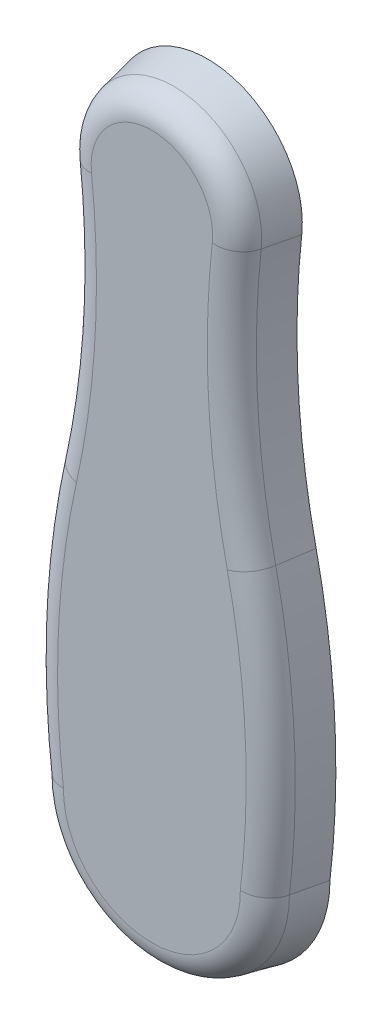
ISO-10303-21;
HEADER;
FILE_DESCRIPTION(('STEP AP214'),'2;1');
FILE_NAME('part.step','',(''),(''),'','','');
FILE_SCHEMA(('AUTOMOTIVE_DESIGN { 1 0 10303 214 1 1 1 1 }'));
ENDSEC;
DATA;
#1=APPLICATION_CONTEXT('core data for automotive mechanical design processes');
#2=APPLICATION_PROTOCOL_DEFINITION('international standard','automotive_design',2000,#1);
#3=PRODUCT_CONTEXT('',#1,'mechanical');
#4=PRODUCT('Part','Part','',(#3));
#5=PRODUCT_RELATED_PRODUCT_CATEGORY('part','',(#4));
#6=PRODUCT_DEFINITION_FORMATION('','',#4);
#7=PRODUCT_DEFINITION_CONTEXT('part definition',#1,'design');
#8=PRODUCT_DEFINITION('design','',#6,#7);
#9=PRODUCT_DEFINITION_SHAPE('','',#8);
#10=(LENGTH_UNIT() NAMED_UNIT(*) SI_UNIT(.MILLI.,.METRE.));
#11=(NAMED_UNIT(*) PLANE_ANGLE_UNIT() SI_UNIT($,.RADIAN.));
#12=(NAMED_UNIT(*) SI_UNIT($,.STERADIAN.) SOLID_ANGLE_UNIT());
#13=UNCERTAINTY_MEASURE_WITH_UNIT(LENGTH_MEASURE(1.E-05),#10,'distance_accuracy_value','');
#14=(GEOMETRIC_REPRESENTATION_CONTEXT(3) GLOBAL_UNCERTAINTY_ASSIGNED_CONTEXT((#13)) GLOBAL_UNIT_ASSIGNED_CONTEXT((#10,
#11,#12)) REPRESENTATION_CONTEXT('',''));
#15=CARTESIAN_POINT('',(0.,0.,0.));
#16=DIRECTION('',(0.,0.,1.));
#17=DIRECTION('',(1.,0.,0.));
#18=AXIS2_PLACEMENT_3D('',#15,#16,#17);
#19=CARTESIAN_POINT('',(-328.083559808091,164.486935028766,20.));
#20=DIRECTION('',(0.,0.,1.));
#21=DIRECTION('',(-1.,0.,0.));
#22=AXIS2_PLACEMENT_3D('',#19,#20,#21);
#23=CONICAL_SURFACE('',#22,300.,0.20943951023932);
#24=DIRECTION('',(-0.203051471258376,0.0446919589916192,-0.978147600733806));
#25=VECTOR('',#24,1.);
#26=CARTESIAN_POINT('',(-35.0964692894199,100.,20.));
#27=LINE('',#26,#25);
#28=CARTESIAN_POINT('',(-36.7407476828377,100.361908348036,12.0791169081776));
#29=VERTEX_POINT('',#28);
#30=CARTESIAN_POINT('',(-39.24822452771,100.913808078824,0.));
#31=VERTEX_POINT('',#30);
#32=EDGE_CURVE('E114',#29,#31,#27,.T.);
#33=ORIENTED_EDGE('',*,*,#32,.F.);
#34=CARTESIAN_POINT('',(-328.083559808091,164.486935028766,12.0791169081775));
#35=DIRECTION('',(0.,0.,-1.));
#36=DIRECTION('',(-1.,0.,0.));
#37=AXIS2_PLACEMENT_3D('',#34,#35,#36);
#38=CIRCLE('',#37,298.316364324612);
#39=CARTESIAN_POINT('',(-31.4996363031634,196.590354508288,12.0791169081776));
#40=VERTEX_POINT('',#39);
#41=EDGE_CURVE('E51',#29,#40,#38,.F.);
#42=ORIENTED_EDGE('',*,*,#41,.T.);
#43=DIRECTION('',(-0.206704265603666,-0.0223744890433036,-0.978147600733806));
#44=VECTOR('',#43,1.);
#45=CARTESIAN_POINT('',(-29.8257781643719,196.77153954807,20.));
#46=LINE('',#45,#44);
#47=CARTESIAN_POINT('',(-34.0522214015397,196.314052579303,0.));
#48=VERTEX_POINT('',#47);
#49=EDGE_CURVE('E140',#40,#48,#46,.T.);
#50=ORIENTED_EDGE('',*,*,#49,.T.);
#51=CARTESIAN_POINT('',(-328.083559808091,164.486935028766,0.));
#52=DIRECTION('',(0.,0.,-1.));
#53=DIRECTION('',(-1.,0.,0.));
#54=AXIS2_PLACEMENT_3D('',#51,#52,#53);
#55=CIRCLE('',#54,295.7488687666);
#56=EDGE_CURVE('E123',#48,#31,#55,.T.);
#57=ORIENTED_EDGE('',*,*,#56,.T.);
#58=EDGE_LOOP('',(#33,#42,#50,#57));
#59=FACE_BOUND('',#58,.T.);
#60=ADVANCED_FACE('F34',(#59),#23,.F.);
#61=CARTESIAN_POINT('',(257.890621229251,35.5130649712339,20.));
#62=DIRECTION('',(0.,0.,-1.));
#63=DIRECTION('',(1.,0.,0.));
#64=AXIS2_PLACEMENT_3D('',#61,#62,#63);
#65=CONICAL_SURFACE('',#64,300.,0.20943951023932);
#66=CARTESIAN_POINT('',(-40.,0.,20.));
#67=CARTESIAN_POINT('',(-40.708515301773,-0.0421104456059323,16.6666804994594));
#68=CARTESIAN_POINT('',(-41.4169712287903,-0.0846628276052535,13.3333540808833));
#69=CARTESIAN_POINT('',(-42.83376433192,-0.170651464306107,6.6666874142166));
#70=CARTESIAN_POINT('',(-43.5421015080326,-0.2140877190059,3.33334716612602));
#71=CARTESIAN_POINT('',(-44.2503793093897,-0.257965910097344,0.));
#72=B_SPLINE_CURVE_WITH_KNOTS('',3,(#66,#67,#68,#69,#70,#71),.UNSPECIFIED.,.F.,.F.,(4,2,4),(0.,
10.2241415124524,20.4482830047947),.UNSPECIFIED.);
#73=CARTESIAN_POINT('',(-41.6835135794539,-0.100889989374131,12.0791169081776));
#74=VERTEX_POINT('',#73);
#75=CARTESIAN_POINT('',(-44.2503793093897,-0.257965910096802,0.));
#76=VERTEX_POINT('',#75);
#77=EDGE_CURVE('E106',#74,#76,#72,.T.);
#78=ORIENTED_EDGE('',*,*,#77,.F.);
#79=CARTESIAN_POINT('',(257.890621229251,35.5130649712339,12.0791169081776));
#80=DIRECTION('',(0.,0.,1.));
#81=DIRECTION('',(1.,0.,0.));
#82=AXIS2_PLACEMENT_3D('',#79,#80,#81);
#83=CIRCLE('',#82,301.683635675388);
#84=EDGE_CURVE('E59',#74,#29,#83,.F.);
#85=ORIENTED_EDGE('',*,*,#84,.T.);
#86=ORIENTED_EDGE('',*,*,#32,.T.);
#87=CARTESIAN_POINT('',(257.890621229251,35.5130649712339,0.));
#88=DIRECTION('',(0.,0.,-1.));
#89=DIRECTION('',(-1.,0.,0.));
#90=AXIS2_PLACEMENT_3D('',#87,#88,#89);
#91=CIRCLE('',#90,304.251131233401);
#92=EDGE_CURVE('E118',#31,#76,#91,.F.);
#93=ORIENTED_EDGE('',*,*,#92,.T.);
#94=EDGE_LOOP('',(#78,#85,#86,#93));
#95=FACE_BOUND('',#94,.T.);
#96=ADVANCED_FACE('F119',(#95),#65,.T.);
#97=CARTESIAN_POINT('',(0.,0.,20.));
#98=DIRECTION('',(0.,0.,-1.));
#99=DIRECTION('',(1.,0.,0.));
#100=AXIS2_PLACEMENT_3D('',#97,#98,#99);
#101=CONICAL_SURFACE('',#100,40.,0.20943951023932);
#102=CARTESIAN_POINT('',(40.,0.,20.));
#103=CARTESIAN_POINT('',(40.7085153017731,-0.0421104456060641,16.6666804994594));
#104=CARTESIAN_POINT('',(41.4169712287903,-0.0846628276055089,13.3333540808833));
#105=CARTESIAN_POINT('',(42.83376433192,-0.17065146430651,6.66668741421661));
#106=CARTESIAN_POINT('',(43.5421015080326,-0.214087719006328,3.33334716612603));
#107=CARTESIAN_POINT('',(44.2503793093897,-0.257965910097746,0.));
#108=B_SPLINE_CURVE_WITH_KNOTS('',3,(#102,#103,#104,#105,#106,#107),.UNSPECIFIED.,.F.,.F.,(4,2,
4),(0.,10.2241415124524,20.4482830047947),.UNSPECIFIED.);
#109=CARTESIAN_POINT('',(41.683513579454,-0.100889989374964,12.0791169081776));
#110=VERTEX_POINT('',#109);
#111=CARTESIAN_POINT('',(44.2503793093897,-0.257965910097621,0.));
#112=VERTEX_POINT('',#111);
#113=EDGE_CURVE('E115',#110,#112,#108,.T.);
#114=ORIENTED_EDGE('',*,*,#113,.F.);
#115=CARTESIAN_POINT('',(0.,0.,12.0791169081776));
#116=DIRECTION('',(0.,0.,1.));
#117=DIRECTION('',(1.,0.,0.));
#118=AXIS2_PLACEMENT_3D('',#115,#116,#117);
#119=CIRCLE('',#118,41.683635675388);
#120=EDGE_CURVE('E43',#110,#74,#119,.F.);
#121=ORIENTED_EDGE('',*,*,#120,.T.);
#122=ORIENTED_EDGE('',*,*,#77,.T.);
#123=CARTESIAN_POINT('',(0.,0.,0.));
#124=DIRECTION('',(0.,0.,-1.));
#125=DIRECTION('',(-1.,0.,0.));
#126=AXIS2_PLACEMENT_3D('',#123,#124,#125);
#127=CIRCLE('',#126,44.2511312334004);
#128=EDGE_CURVE('E111',#76,#112,#127,.F.);
#129=ORIENTED_EDGE('',*,*,#128,.T.);
#130=EDGE_LOOP('',(#114,#121,#122,#129));
#131=FACE_BOUND('',#130,.T.);
#132=ADVANCED_FACE('F109',(#131),#101,.T.);
#133=CARTESIAN_POINT('',(-257.890621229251,35.513064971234,20.));
#134=DIRECTION('',(0.,0.,-1.));
#135=DIRECTION('',(-1.,0.,0.));
#136=AXIS2_PLACEMENT_3D('',#133,#134,#135);
#137=CONICAL_SURFACE('',#136,300.,0.20943951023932);
#138=DIRECTION('',(0.203051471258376,0.0446919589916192,-0.978147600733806));
#139=VECTOR('',#138,1.);
#140=CARTESIAN_POINT('',(35.0964692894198,100.,20.));
#141=LINE('',#140,#139);
#142=CARTESIAN_POINT('',(36.7407476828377,100.361908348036,12.0791169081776));
#143=VERTEX_POINT('',#142);
#144=CARTESIAN_POINT('',(39.24822452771,100.913808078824,0.));
#145=VERTEX_POINT('',#144);
#146=EDGE_CURVE('E133',#143,#145,#141,.T.);
#147=ORIENTED_EDGE('',*,*,#146,.F.);
#148=CARTESIAN_POINT('',(-257.890621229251,35.513064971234,12.0791169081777));
#149=DIRECTION('',(0.,0.,1.));
#150=DIRECTION('',(1.,0.,0.));
#151=AXIS2_PLACEMENT_3D('',#148,#149,#150);
#152=CIRCLE('',#151,301.683635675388);
#153=EDGE_CURVE('E156',#143,#110,#152,.F.);
#154=ORIENTED_EDGE('',*,*,#153,.T.);
#155=ORIENTED_EDGE('',*,*,#113,.T.);
#156=CARTESIAN_POINT('',(-257.890621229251,35.513064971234,0.));
#157=DIRECTION('',(0.,0.,-1.));
#158=DIRECTION('',(-1.,0.,0.));
#159=AXIS2_PLACEMENT_3D('',#156,#157,#158);
#160=CIRCLE('',#159,304.2511312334);
#161=EDGE_CURVE('E128',#112,#145,#160,.F.);
#162=ORIENTED_EDGE('',*,*,#161,.T.);
#163=EDGE_LOOP('',(#147,#154,#155,#162));
#164=FACE_BOUND('',#163,.T.);
#165=ADVANCED_FACE('F217',(#164),#137,.T.);
#166=CARTESIAN_POINT('',(328.08355980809,164.486935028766,20.));
#167=DIRECTION('',(0.,0.,1.));
#168=DIRECTION('',(1.,0.,0.));
#169=AXIS2_PLACEMENT_3D('',#166,#167,#168);
#170=CONICAL_SURFACE('',#169,300.,0.20943951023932);
#171=DIRECTION('',(0.206704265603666,-0.0223744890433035,-0.978147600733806));
#172=VECTOR('',#171,1.);
#173=CARTESIAN_POINT('',(29.8257781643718,196.77153954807,20.));
#174=LINE('',#173,#172);
#175=CARTESIAN_POINT('',(31.4996363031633,196.590354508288,12.0791169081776));
#176=VERTEX_POINT('',#175);
#177=CARTESIAN_POINT('',(34.0522214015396,196.314052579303,0.));
#178=VERTEX_POINT('',#177);
#179=EDGE_CURVE('E224',#176,#178,#174,.T.);
#180=ORIENTED_EDGE('',*,*,#179,.F.);
#181=CARTESIAN_POINT('',(328.08355980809,164.486935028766,12.0791169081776));
#182=DIRECTION('',(0.,0.,-1.));
#183=DIRECTION('',(-1.,0.,0.));
#184=AXIS2_PLACEMENT_3D('',#181,#182,#183);
#185=CIRCLE('',#184,298.316364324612);
#186=EDGE_CURVE('E159',#176,#143,#185,.F.);
#187=ORIENTED_EDGE('',*,*,#186,.T.);
#188=ORIENTED_EDGE('',*,*,#146,.T.);
#189=CARTESIAN_POINT('',(328.08355980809,164.486935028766,0.));
#190=DIRECTION('',(0.,0.,-1.));
#191=DIRECTION('',(-1.,0.,0.));
#192=AXIS2_PLACEMENT_3D('',#189,#190,#191);
#193=CIRCLE('',#192,295.748868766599);
#194=EDGE_CURVE('E130',#145,#178,#193,.T.);
#195=ORIENTED_EDGE('',*,*,#194,.T.);
#196=EDGE_LOOP('',(#180,#187,#188,#195));
#197=FACE_BOUND('',#196,.T.);
#198=ADVANCED_FACE('F214',(#197),#170,.F.);
#199=CARTESIAN_POINT('',(0.,200.,20.));
#200=DIRECTION('',(0.,0.,-1.));
#201=DIRECTION('',(1.,0.,0.));
#202=AXIS2_PLACEMENT_3D('',#199,#200,#201);
#203=CONICAL_SURFACE('',#202,29.9999999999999,0.20943951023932);
#204=ORIENTED_EDGE('',*,*,#49,.F.);
#205=CARTESIAN_POINT('',(0.,200.,12.0791169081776));
#206=DIRECTION('',(0.,0.,1.));
#207=DIRECTION('',(1.,0.,0.));
#208=AXIS2_PLACEMENT_3D('',#205,#206,#207);
#209=CIRCLE('',#208,31.6836356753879);
#210=EDGE_CURVE('E11',#40,#176,#209,.F.);
#211=ORIENTED_EDGE('',*,*,#210,.T.);
#212=ORIENTED_EDGE('',*,*,#179,.T.);
#213=CARTESIAN_POINT('',(0.,200.,0.));
#214=DIRECTION('',(0.,0.,-1.));
#215=DIRECTION('',(-1.,0.,0.));
#216=AXIS2_PLACEMENT_3D('',#213,#214,#215);
#217=CIRCLE('',#216,34.2511312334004);
#218=EDGE_CURVE('E137',#178,#48,#217,.F.);
#219=ORIENTED_EDGE('',*,*,#218,.T.);
#220=EDGE_LOOP('',(#204,#211,#212,#219));
#221=FACE_BOUND('',#220,.T.);
#222=ADVANCED_FACE('F211',(#221),#203,.T.);
#223=CARTESIAN_POINT('',(-35.0964692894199,100.,20.));
#224=DIRECTION('',(0.,0.,-1.));
#225=DIRECTION('',(-1.,0.,0.));
#226=AXIS2_PLACEMENT_3D('',#223,#224,#225);
#227=PLANE('',#226);
#228=CARTESIAN_POINT('',(257.890621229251,35.5130649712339,20.));
#229=DIRECTION('',(0.,0.,-1.));
#230=DIRECTION('',(-1.,0.,0.));
#231=AXIS2_PLACEMENT_3D('',#228,#229,#230);
#232=CIRCLE('',#231,291.90215966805);
#233=CARTESIAN_POINT('',(-27.1879270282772,98.2593169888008,20.));
#234=VERTEX_POINT('',#233);
#235=CARTESIAN_POINT('',(-31.8988833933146,0.457197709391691,20.));
#236=VERTEX_POINT('',#235);
#237=EDGE_CURVE('E147',#234,#236,#232,.F.);
#238=ORIENTED_EDGE('',*,*,#237,.T.);
#239=CARTESIAN_POINT('',(0.,0.,20.));
#240=DIRECTION('',(0.,0.,-1.));
#241=DIRECTION('',(-1.,0.,0.));
#242=AXIS2_PLACEMENT_3D('',#239,#240,#241);
#243=CIRCLE('',#242,31.9021596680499);
#244=CARTESIAN_POINT('',(31.8988833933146,0.457197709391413,20.));
#245=VERTEX_POINT('',#244);
#246=EDGE_CURVE('E154',#236,#245,#243,.F.);
#247=ORIENTED_EDGE('',*,*,#246,.T.);
#248=CARTESIAN_POINT('',(-257.890621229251,35.513064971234,20.));
#249=DIRECTION('',(0.,0.,-1.));
#250=DIRECTION('',(-1.,0.,0.));
#251=AXIS2_PLACEMENT_3D('',#248,#249,#250);
#252=CIRCLE('',#251,291.90215966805);
#253=CARTESIAN_POINT('',(27.1879270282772,98.2593169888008,20.));
#254=VERTEX_POINT('',#253);
#255=EDGE_CURVE('E151',#245,#254,#252,.F.);
#256=ORIENTED_EDGE('',*,*,#255,.T.);
#257=CARTESIAN_POINT('',(328.08355980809,164.486935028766,20.));
#258=DIRECTION('',(0.,0.,-1.));
#259=DIRECTION('',(-1.,0.,0.));
#260=AXIS2_PLACEMENT_3D('',#257,#258,#259);
#261=CIRCLE('',#260,308.09784033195);
#262=CARTESIAN_POINT('',(21.7749651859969,197.642991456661,20.));
#263=VERTEX_POINT('',#262);
#264=EDGE_CURVE('E149',#254,#263,#261,.T.);
#265=ORIENTED_EDGE('',*,*,#264,.T.);
#266=CARTESIAN_POINT('',(0.,200.,20.));
#267=DIRECTION('',(0.,0.,-1.));
#268=DIRECTION('',(-1.,0.,0.));
#269=AXIS2_PLACEMENT_3D('',#266,#267,#268);
#270=CIRCLE('',#269,21.9021596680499);
#271=CARTESIAN_POINT('',(-21.7749651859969,197.642991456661,20.));
#272=VERTEX_POINT('',#271);
#273=EDGE_CURVE('E143',#263,#272,#270,.F.);
#274=ORIENTED_EDGE('',*,*,#273,.T.);
#275=CARTESIAN_POINT('',(-328.083559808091,164.486935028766,20.));
#276=DIRECTION('',(0.,0.,-1.));
#277=DIRECTION('',(-1.,0.,0.));
#278=AXIS2_PLACEMENT_3D('',#275,#276,#277);
#279=CIRCLE('',#278,308.09784033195);
#280=EDGE_CURVE('E145',#272,#234,#279,.T.);
#281=ORIENTED_EDGE('',*,*,#280,.T.);
#282=EDGE_LOOP('',(#238,#247,#256,#265,#274,#281));
#283=FACE_BOUND('',#282,.T.);
#284=ADVANCED_FACE('F213',(#283),#227,.F.);
#285=CARTESIAN_POINT('',(-35.0964692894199,100.,0.));
#286=DIRECTION('',(0.,0.,-1.));
#287=DIRECTION('',(-1.,0.,0.));
#288=AXIS2_PLACEMENT_3D('',#285,#286,#287);
#289=PLANE('',#288);
#290=ORIENTED_EDGE('',*,*,#56,.F.);
#291=ORIENTED_EDGE('',*,*,#218,.F.);
#292=ORIENTED_EDGE('',*,*,#194,.F.);
#293=ORIENTED_EDGE('',*,*,#161,.F.);
#294=ORIENTED_EDGE('',*,*,#128,.F.);
#295=ORIENTED_EDGE('',*,*,#92,.F.);
#296=EDGE_LOOP('',(#290,#291,#292,#293,#294,#295));
#297=FACE_BOUND('',#296,.T.);
#298=ADVANCED_FACE('F125',(#297),#289,.T.);
#299=CARTESIAN_POINT('',(-328.083559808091,164.486935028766,9.99999999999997));
#300=DIRECTION('',(0.,0.,-1.));
#301=DIRECTION('',(-1.,0.,0.));
#302=AXIS2_PLACEMENT_3D('',#299,#300,#301);
#303=TOROIDAL_SURFACE('',#302,308.09784033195,10.);
#304=CARTESIAN_POINT('',(-21.774965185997,197.642991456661,10.));
#305=DIRECTION('',(-0.107615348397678,0.994192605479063,0.));
#306=DIRECTION('',(-0.994192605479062,-0.107615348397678,0.));
#307=AXIS2_PLACEMENT_3D('',#304,#305,#306);
#308=CIRCLE('',#307,10.);
#309=EDGE_CURVE('E192',#40,#272,#308,.T.);
#310=ORIENTED_EDGE('',*,*,#309,.F.);
#311=ORIENTED_EDGE('',*,*,#41,.F.);
#312=CARTESIAN_POINT('',(-27.1879270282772,98.2593169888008,10.));
#313=DIRECTION('',(-0.214956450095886,-0.976623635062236,0.));
#314=DIRECTION('',(0.976623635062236,-0.214956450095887,0.));
#315=AXIS2_PLACEMENT_3D('',#312,#313,#314);
#316=CIRCLE('',#315,10.);
#317=EDGE_CURVE('E38',#234,#29,#316,.T.);
#318=ORIENTED_EDGE('',*,*,#317,.F.);
#319=ORIENTED_EDGE('',*,*,#280,.F.);
#320=EDGE_LOOP('',(#310,#311,#318,#319));
#321=FACE_BOUND('',#320,.T.);
#322=ADVANCED_FACE('F36',(#321),#303,.T.);
#323=CARTESIAN_POINT('',(257.890621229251,35.5130649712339,10.));
#324=DIRECTION('',(0.,0.,-1.));
#325=DIRECTION('',(-1.,0.,0.));
#326=AXIS2_PLACEMENT_3D('',#323,#324,#325);
#327=TOROIDAL_SURFACE('',#326,291.90215966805,10.);
#328=ORIENTED_EDGE('',*,*,#317,.T.);
#329=ORIENTED_EDGE('',*,*,#84,.F.);
#330=CARTESIAN_POINT('',(-41.683513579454,-0.100889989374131,12.0791169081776));
#331=CARTESIAN_POINT('',(-41.6251206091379,-0.097360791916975,12.3540199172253));
#332=CARTESIAN_POINT('',(-41.5550848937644,-0.0931299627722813,12.6264345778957));
#333=CARTESIAN_POINT('',(-41.3923628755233,-0.0833142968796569,13.1643726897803));
#334=CARTESIAN_POINT('',(-41.2996777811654,-0.0777295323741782,13.4298965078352));
#335=CARTESIAN_POINT('',(-41.0923535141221,-0.0652589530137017,13.95199698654));
#336=CARTESIAN_POINT('',(-40.9777287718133,-0.0583739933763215,14.208579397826));
#337=CARTESIAN_POINT('',(-40.727316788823,-0.0433647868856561,14.7111589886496));
#338=CARTESIAN_POINT('',(-40.5915297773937,-0.0352405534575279,14.9571562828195));
#339=CARTESIAN_POINT('',(-40.2996914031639,-0.0178229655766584,15.4369377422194));
#340=CARTESIAN_POINT('',(-40.1436304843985,-0.00852905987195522,15.6707160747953));
#341=CARTESIAN_POINT('',(-39.8124064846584,0.0111400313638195,16.1242835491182));
#342=CARTESIAN_POINT('',(-39.6372429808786,0.0215152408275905,16.3440723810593));
#343=CARTESIAN_POINT('',(-39.2691367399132,0.0432482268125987,16.7680201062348));
#344=CARTESIAN_POINT('',(-39.076200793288,0.0546056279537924,16.9721849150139));
#345=CARTESIAN_POINT('',(-38.6738684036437,0.0782036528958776,17.3635361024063));
#346=CARTESIAN_POINT('',(-38.4644720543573,0.090444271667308,17.5507225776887));
#347=CARTESIAN_POINT('',(-38.0305438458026,0.115708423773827,17.9069347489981));
#348=CARTESIAN_POINT('',(-37.806000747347,0.12873253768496,18.0759467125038));
#349=CARTESIAN_POINT('',(-37.3435155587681,0.155439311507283,18.3944605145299));
#350=CARTESIAN_POINT('',(-37.1055734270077,0.169121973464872,18.5439622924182));
#351=CARTESIAN_POINT('',(-36.6177515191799,0.197038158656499,18.8225367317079));
#352=CARTESIAN_POINT('',(-36.3678608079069,0.211272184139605,18.9515901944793));
#353=CARTESIAN_POINT('',(-35.8581312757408,0.2401542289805,19.1881910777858));
#354=CARTESIAN_POINT('',(-35.5982927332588,0.254802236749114,19.295739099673));
#355=CARTESIAN_POINT('',(-35.06376673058,0.284764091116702,19.491043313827));
#356=CARTESIAN_POINT('',(-34.7888695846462,0.300085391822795,19.5782249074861));
#357=CARTESIAN_POINT('',(-34.2325921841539,0.330894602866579,19.7285439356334));
#358=CARTESIAN_POINT('',(-33.9512121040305,0.346382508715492,19.7916820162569));
#359=CARTESIAN_POINT('',(-33.384800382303,0.377349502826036,19.8933289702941));
#360=CARTESIAN_POINT('',(-33.0997798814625,0.392828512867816,19.9319002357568));
#361=CARTESIAN_POINT('',(-32.527610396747,0.423679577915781,19.9843711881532));
#362=CARTESIAN_POINT('',(-32.2404631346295,0.439051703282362,19.9982890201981));
#363=CARTESIAN_POINT('',(-31.9352137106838,0.455268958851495,19.9999506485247));
#364=CARTESIAN_POINT('',(-31.9170482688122,0.456233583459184,20.0000000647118));
#365=CARTESIAN_POINT('',(-31.8988833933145,0.457197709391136,20.));
#366=B_SPLINE_CURVE_WITH_KNOTS('',3,(#330,#331,#332,#333,#334,#335,#336,#337,#338,#339,#340,
#341,#342,#343,#344,#345,#346,#347,#348,#349,#350,#351,#352,#353,#354,#355,#356,#357,#358,#359,
#360,#361,#362,#363,#364,#365),.UNSPECIFIED.,.F.,.F.,(4,2,2,2,2,2,2,2,2,2,2,2,2,2,2,2,2,4),(0.,
0.842916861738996,1.68578875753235,2.52810816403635,3.3704184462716,4.21312719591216,
5.05585460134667,5.89826133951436,6.74066328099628,7.583697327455,8.42673399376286,
9.27055754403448,10.1143574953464,10.979673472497,11.8449661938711,12.7080524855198,
13.5705032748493,13.6250762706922),.UNSPECIFIED.);
#367=EDGE_CURVE('E187',#236,#74,#366,.F.);
#368=ORIENTED_EDGE('',*,*,#367,.F.);
#369=ORIENTED_EDGE('',*,*,#237,.F.);
#370=EDGE_LOOP('',(#328,#329,#368,#369));
#371=FACE_BOUND('',#370,.T.);
#372=ADVANCED_FACE('F193',(#371),#327,.T.);
#373=CARTESIAN_POINT('',(0.,200.,10.));
#374=DIRECTION('',(0.,0.,-1.));
#375=DIRECTION('',(-1.,0.,0.));
#376=AXIS2_PLACEMENT_3D('',#373,#374,#375);
#377=TOROIDAL_SURFACE('',#376,21.9021596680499,10.);
#378=ORIENTED_EDGE('',*,*,#309,.T.);
#379=ORIENTED_EDGE('',*,*,#273,.F.);
#380=CARTESIAN_POINT('',(21.7749651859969,197.642991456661,10.));
#381=DIRECTION('',(-0.107615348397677,-0.994192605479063,0.));
#382=DIRECTION('',(0.994192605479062,-0.107615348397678,0.));
#383=AXIS2_PLACEMENT_3D('',#380,#381,#382);
#384=CIRCLE('',#383,10.);
#385=EDGE_CURVE('E173',#176,#263,#384,.T.);
#386=ORIENTED_EDGE('',*,*,#385,.F.);
#387=ORIENTED_EDGE('',*,*,#210,.F.);
#388=EDGE_LOOP('',(#378,#379,#386,#387));
#389=FACE_BOUND('',#388,.T.);
#390=ADVANCED_FACE('F183',(#389),#377,.T.);
#391=CARTESIAN_POINT('',(0.,0.,10.));
#392=DIRECTION('',(0.,0.,-1.));
#393=DIRECTION('',(-1.,0.,0.));
#394=AXIS2_PLACEMENT_3D('',#391,#392,#393);
#395=TOROIDAL_SURFACE('',#394,31.9021596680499,10.);
#396=ORIENTED_EDGE('',*,*,#367,.T.);
#397=ORIENTED_EDGE('',*,*,#120,.F.);
#398=CARTESIAN_POINT('',(41.683513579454,-0.100889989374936,12.0791169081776));
#399=CARTESIAN_POINT('',(41.6251206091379,-0.0973607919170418,12.3540199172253));
#400=CARTESIAN_POINT('',(41.5550848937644,-0.0931299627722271,12.6264345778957));
#401=CARTESIAN_POINT('',(41.3923628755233,-0.0833142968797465,13.1643726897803));
#402=CARTESIAN_POINT('',(41.2996777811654,-0.0777295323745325,13.4298965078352));
#403=CARTESIAN_POINT('',(41.0923535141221,-0.0652589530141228,13.95199698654));
#404=CARTESIAN_POINT('',(40.9777287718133,-0.058373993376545,14.2085793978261));
#405=CARTESIAN_POINT('',(40.7273167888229,-0.0433647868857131,14.7111589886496));
#406=CARTESIAN_POINT('',(40.5915297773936,-0.0352405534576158,14.9571562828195));
#407=CARTESIAN_POINT('',(40.2996914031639,-0.0178229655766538,15.4369377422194));
#408=CARTESIAN_POINT('',(40.1436304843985,-0.00852905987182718,15.6707160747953));
#409=CARTESIAN_POINT('',(39.8124064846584,0.0111400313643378,16.1242835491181));
#410=CARTESIAN_POINT('',(39.6372429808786,0.0215152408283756,16.3440723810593));
#411=CARTESIAN_POINT('',(39.2691367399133,0.0432482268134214,16.7680201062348));
#412=CARTESIAN_POINT('',(39.076200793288,0.0546056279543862,16.9721849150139));
#413=CARTESIAN_POINT('',(38.6738684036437,0.0782036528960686,17.3635361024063));
#414=CARTESIAN_POINT('',(38.4644720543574,0.0904442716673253,17.5507225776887));
#415=CARTESIAN_POINT('',(38.0305438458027,0.11570842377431,17.9069347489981));
#416=CARTESIAN_POINT('',(37.8060007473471,0.128732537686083,18.0759467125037));
#417=CARTESIAN_POINT('',(37.3435155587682,0.15543931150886,18.3944605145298));
#418=CARTESIAN_POINT('',(37.1055734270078,0.169121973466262,18.5439622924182));
#419=CARTESIAN_POINT('',(36.6177515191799,0.197038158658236,18.8225367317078));
#420=CARTESIAN_POINT('',(36.367860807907,0.211272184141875,18.9515901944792));
#421=CARTESIAN_POINT('',(35.8581312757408,0.240154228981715,19.1881910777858));
#422=CARTESIAN_POINT('',(35.5982927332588,0.25480223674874,19.2957390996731));
#423=CARTESIAN_POINT('',(35.06376673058,0.284764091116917,19.491043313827));
#424=CARTESIAN_POINT('',(34.7888695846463,0.300085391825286,19.578224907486));
#425=CARTESIAN_POINT('',(34.2325921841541,0.330894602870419,19.7285439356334));
#426=CARTESIAN_POINT('',(33.9512121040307,0.346382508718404,19.7916820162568));
#427=CARTESIAN_POINT('',(33.3848003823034,0.377349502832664,19.893328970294));
#428=CARTESIAN_POINT('',(33.0997798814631,0.392828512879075,19.9319002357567));
#429=CARTESIAN_POINT('',(32.5276103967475,0.423679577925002,19.9843711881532));
#430=CARTESIAN_POINT('',(32.2404631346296,0.439051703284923,19.9982890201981));
#431=CARTESIAN_POINT('',(31.9352137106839,0.455268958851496,19.9999506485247));
#432=CARTESIAN_POINT('',(31.9170482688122,0.45623358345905,20.0000000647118));
#433=CARTESIAN_POINT('',(31.8988833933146,0.457197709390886,20.));
#434=B_SPLINE_CURVE_WITH_KNOTS('',3,(#398,#399,#400,#401,#402,#403,#404,#405,#406,#407,#408,
#409,#410,#411,#412,#413,#414,#415,#416,#417,#418,#419,#420,#421,#422,#423,#424,#425,#426,#427,
#428,#429,#430,#431,#432,#433),.UNSPECIFIED.,.F.,.F.,(4,2,2,2,2,2,2,2,2,2,2,2,2,2,2,2,2,4),(0.,
0.842916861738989,1.68578875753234,2.52810816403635,3.37041844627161,4.21312719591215,
5.05585460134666,5.89826133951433,6.74066328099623,7.58369732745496,8.42673399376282,
9.27055754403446,10.1143574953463,10.9796734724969,11.844966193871,12.7080524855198,
13.5705032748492,13.6250762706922),.UNSPECIFIED.);
#435=EDGE_CURVE('E166',#245,#110,#434,.F.);
#436=ORIENTED_EDGE('',*,*,#435,.F.);
#437=ORIENTED_EDGE('',*,*,#246,.F.);
#438=EDGE_LOOP('',(#396,#397,#436,#437));
#439=FACE_BOUND('',#438,.T.);
#440=ADVANCED_FACE('F178',(#439),#395,.T.);
#441=CARTESIAN_POINT('',(328.08355980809,164.486935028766,10.0000000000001));
#442=DIRECTION('',(0.,0.,-1.));
#443=DIRECTION('',(-1.,0.,0.));
#444=AXIS2_PLACEMENT_3D('',#441,#442,#443);
#445=TOROIDAL_SURFACE('',#444,308.09784033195,10.);
#446=ORIENTED_EDGE('',*,*,#385,.T.);
#447=ORIENTED_EDGE('',*,*,#264,.F.);
#448=CARTESIAN_POINT('',(27.1879270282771,98.2593169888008,10.));
#449=DIRECTION('',(0.214956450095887,-0.976623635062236,0.));
#450=DIRECTION('',(0.976623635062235,0.214956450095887,0.));
#451=AXIS2_PLACEMENT_3D('',#448,#449,#450);
#452=CIRCLE('',#451,10.);
#453=EDGE_CURVE('E164',#143,#254,#452,.T.);
#454=ORIENTED_EDGE('',*,*,#453,.F.);
#455=ORIENTED_EDGE('',*,*,#186,.F.);
#456=EDGE_LOOP('',(#446,#447,#454,#455));
#457=FACE_BOUND('',#456,.T.);
#458=ADVANCED_FACE('F182',(#457),#445,.T.);
#459=CARTESIAN_POINT('',(-257.890621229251,35.513064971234,9.99999999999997));
#460=DIRECTION('',(0.,0.,-1.));
#461=DIRECTION('',(-1.,0.,0.));
#462=AXIS2_PLACEMENT_3D('',#459,#460,#461);
#463=TOROIDAL_SURFACE('',#462,291.90215966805,10.);
#464=ORIENTED_EDGE('',*,*,#435,.T.);
#465=ORIENTED_EDGE('',*,*,#153,.F.);
#466=ORIENTED_EDGE('',*,*,#453,.T.);
#467=ORIENTED_EDGE('',*,*,#255,.F.);
#468=EDGE_LOOP('',(#464,#465,#466,#467));
#469=FACE_BOUND('',#468,.T.);
#470=ADVANCED_FACE('F175',(#469),#463,.T.);
#471=CLOSED_SHELL('',(#60,#96,#132,#165,#198,#222,#284,#298,#322,#372,#390,#440,#458,#470));
#472=MANIFOLD_SOLID_BREP('B2',#471);
#473=ADVANCED_BREP_SHAPE_REPRESENTATION('',(#18,#472),#14);
#474=SHAPE_DEFINITION_REPRESENTATION(#9,#473);
ENDSEC;
END-ISO-10303-21;
